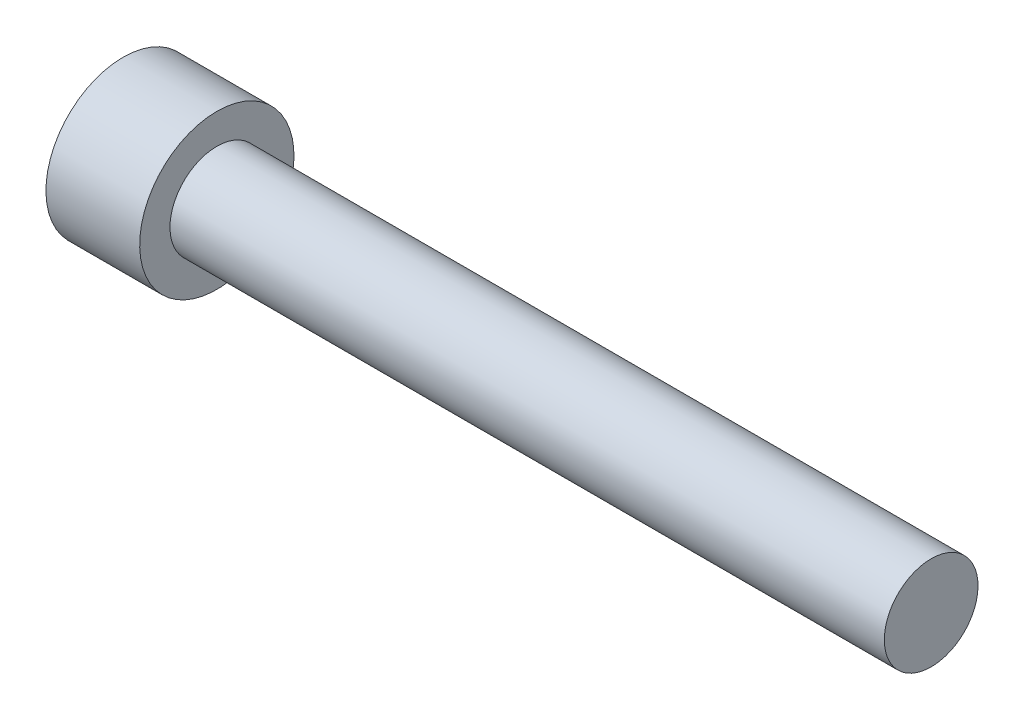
from build123d import *

# Parameters (mm, degrees)
CUT_EXTRUDE1_DEPTH = 4.826


with BuildPart() as part:
    # Sketch1 → Revolve1 (revolve)
    with BuildSketch(Plane.XY):
        Polygon((35.9156, 0), (0, 0), (0, 3.429), (4.1656, 3.429), (4.1656, 2.0828), (35.9156, 2.0828), align=None)
    revolve(axis=Axis((35.9156, 0, 0), (-1, 0, 0)))

    # Sketch2 → Cut-Extrude1 (cut)
    with BuildSketch(Plane.ZY):
        Polygon((2.062222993, 0), (1.031111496, 1.7859375), (-1.031111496, 1.7859375), (-2.062222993, 0), (-1.031111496, -1.7859375), (1.031111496, -1.7859375), align=None)
    extrude(amount=-CUT_EXTRUDE1_DEPTH, mode=Mode.SUBTRACT)


solid = part.part
